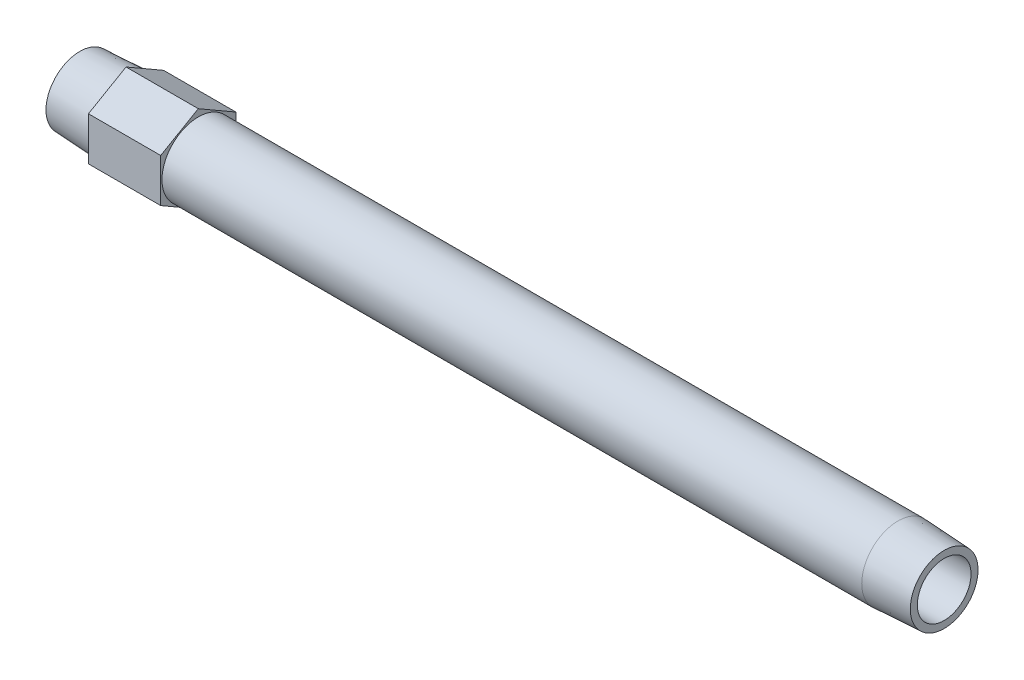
ISO-10303-21;
HEADER;
FILE_DESCRIPTION(('STEP AP214'),'2;1');
FILE_NAME('part.step','',(''),(''),'','','');
FILE_SCHEMA(('AUTOMOTIVE_DESIGN { 1 0 10303 214 1 1 1 1 }'));
ENDSEC;
DATA;
#1=APPLICATION_CONTEXT('core data for automotive mechanical design processes');
#2=APPLICATION_PROTOCOL_DEFINITION('international standard','automotive_design',2000,#1);
#3=PRODUCT_CONTEXT('',#1,'mechanical');
#4=PRODUCT('Part','Part','',(#3));
#5=PRODUCT_RELATED_PRODUCT_CATEGORY('part','',(#4));
#6=PRODUCT_DEFINITION_FORMATION('','',#4);
#7=PRODUCT_DEFINITION_CONTEXT('part definition',#1,'design');
#8=PRODUCT_DEFINITION('design','',#6,#7);
#9=PRODUCT_DEFINITION_SHAPE('','',#8);
#10=(LENGTH_UNIT() NAMED_UNIT(*) SI_UNIT(.MILLI.,.METRE.));
#11=(NAMED_UNIT(*) PLANE_ANGLE_UNIT() SI_UNIT($,.RADIAN.));
#12=(NAMED_UNIT(*) SI_UNIT($,.STERADIAN.) SOLID_ANGLE_UNIT());
#13=UNCERTAINTY_MEASURE_WITH_UNIT(LENGTH_MEASURE(1.E-05),#10,'distance_accuracy_value','');
#14=(GEOMETRIC_REPRESENTATION_CONTEXT(3) GLOBAL_UNCERTAINTY_ASSIGNED_CONTEXT((#13)) GLOBAL_UNIT_ASSIGNED_CONTEXT((#10,
#11,#12)) REPRESENTATION_CONTEXT('',''));
#15=CARTESIAN_POINT('',(0.,0.,0.));
#16=DIRECTION('',(0.,0.,1.));
#17=DIRECTION('',(1.,0.,0.));
#18=AXIS2_PLACEMENT_3D('',#15,#16,#17);
#19=CARTESIAN_POINT('',(0.,0.,-9.95716184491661));
#20=DIRECTION('',(1.,0.,0.));
#21=DIRECTION('',(0.,0.,-1.));
#22=AXIS2_PLACEMENT_3D('',#19,#20,#21);
#23=PLANE('',#22);
#24=CARTESIAN_POINT('',(0.,0.,0.));
#25=DIRECTION('',(-1.,0.,0.));
#26=DIRECTION('',(0.,0.,1.));
#27=AXIS2_PLACEMENT_3D('',#24,#25,#26);
#28=CIRCLE('',#27,9.95716184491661);
#29=CARTESIAN_POINT('',(0.,0.,9.95716184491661));
#30=VERTEX_POINT('',#29);
#31=EDGE_CURVE('E147',#30,#30,#28,.T.);
#32=ORIENTED_EDGE('',*,*,#31,.T.);
#33=EDGE_LOOP('',(#32));
#34=FACE_BOUND('',#33,.T.);
#35=CARTESIAN_POINT('',(0.,0.,0.));
#36=DIRECTION('',(1.,0.,0.));
#37=DIRECTION('',(0.,0.,1.));
#38=AXIS2_PLACEMENT_3D('',#35,#36,#37);
#39=CIRCLE('',#38,7.8994);
#40=CARTESIAN_POINT('',(0.,0.,7.8994));
#41=VERTEX_POINT('',#40);
#42=EDGE_CURVE('E159',#41,#41,#39,.T.);
#43=ORIENTED_EDGE('',*,*,#42,.T.);
#44=EDGE_LOOP('',(#43));
#45=FACE_BOUND('',#44,.T.);
#46=ADVANCED_FACE('F15',(#34,#45),#23,.F.);
#47=CARTESIAN_POINT('',(254.,0.,-9.95716184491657));
#48=DIRECTION('',(-1.,0.,0.));
#49=DIRECTION('',(0.,0.,1.));
#50=AXIS2_PLACEMENT_3D('',#47,#48,#49);
#51=PLANE('',#50);
#52=CARTESIAN_POINT('',(254.,0.,0.));
#53=DIRECTION('',(-1.,0.,0.));
#54=DIRECTION('',(0.,0.,1.));
#55=AXIS2_PLACEMENT_3D('',#52,#53,#54);
#56=CIRCLE('',#55,9.95716184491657);
#57=CARTESIAN_POINT('',(254.,0.,9.95716184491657));
#58=VERTEX_POINT('',#57);
#59=EDGE_CURVE('E150',#58,#58,#56,.T.);
#60=ORIENTED_EDGE('',*,*,#59,.F.);
#61=EDGE_LOOP('',(#60));
#62=FACE_BOUND('',#61,.T.);
#63=CARTESIAN_POINT('',(254.,0.,0.));
#64=DIRECTION('',(-1.,0.,0.));
#65=DIRECTION('',(0.,0.,1.));
#66=AXIS2_PLACEMENT_3D('',#63,#64,#65);
#67=CIRCLE('',#66,7.8994);
#68=CARTESIAN_POINT('',(254.,0.,7.8994));
#69=VERTEX_POINT('',#68);
#70=EDGE_CURVE('E156',#69,#69,#67,.F.);
#71=ORIENTED_EDGE('',*,*,#70,.F.);
#72=EDGE_LOOP('',(#71));
#73=FACE_BOUND('',#72,.T.);
#74=ADVANCED_FACE('F178',(#62,#73),#51,.F.);
#75=CARTESIAN_POINT('',(34.798,-6.37914312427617,-11.049));
#76=DIRECTION('',(1.,0.,0.));
#77=DIRECTION('',(0.,1.,0.));
#78=AXIS2_PLACEMENT_3D('',#75,#76,#77);
#79=PLANE('',#78);
#80=DIRECTION('',(0.,0.5,-0.866025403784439));
#81=VECTOR('',#80,1.);
#82=CARTESIAN_POINT('',(34.798,-12.7582862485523,0.));
#83=LINE('',#82,#81);
#84=CARTESIAN_POINT('',(34.798,-12.7582862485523,0.));
#85=VERTEX_POINT('',#84);
#86=CARTESIAN_POINT('',(34.798,-6.37914312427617,-11.049));
#87=VERTEX_POINT('',#86);
#88=EDGE_CURVE('E103',#85,#87,#83,.T.);
#89=ORIENTED_EDGE('',*,*,#88,.T.);
#90=DIRECTION('',(0.,1.,0.));
#91=VECTOR('',#90,1.);
#92=CARTESIAN_POINT('',(34.798,-6.37914312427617,-11.049));
#93=LINE('',#92,#91);
#94=CARTESIAN_POINT('',(34.798,6.37914312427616,-11.049));
#95=VERTEX_POINT('',#94);
#96=EDGE_CURVE('E83',#87,#95,#93,.T.);
#97=ORIENTED_EDGE('',*,*,#96,.T.);
#98=DIRECTION('',(0.,0.5,0.866025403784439));
#99=VECTOR('',#98,1.);
#100=CARTESIAN_POINT('',(34.798,6.37914312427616,-11.049));
#101=LINE('',#100,#99);
#102=CARTESIAN_POINT('',(34.798,12.7582862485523,0.));
#103=VERTEX_POINT('',#102);
#104=EDGE_CURVE('E102',#95,#103,#101,.T.);
#105=ORIENTED_EDGE('',*,*,#104,.T.);
#106=DIRECTION('',(0.,-0.5,0.866025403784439));
#107=VECTOR('',#106,1.);
#108=CARTESIAN_POINT('',(34.798,12.7582862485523,0.));
#109=LINE('',#108,#107);
#110=CARTESIAN_POINT('',(34.798,6.37914312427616,11.049));
#111=VERTEX_POINT('',#110);
#112=EDGE_CURVE('E105',#103,#111,#109,.T.);
#113=ORIENTED_EDGE('',*,*,#112,.T.);
#114=DIRECTION('',(0.,-1.,0.));
#115=VECTOR('',#114,1.);
#116=CARTESIAN_POINT('',(34.798,6.37914312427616,11.049));
#117=LINE('',#116,#115);
#118=CARTESIAN_POINT('',(34.798,-6.37914312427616,11.049));
#119=VERTEX_POINT('',#118);
#120=EDGE_CURVE('E35',#111,#119,#117,.T.);
#121=ORIENTED_EDGE('',*,*,#120,.T.);
#122=DIRECTION('',(0.,-0.5,-0.866025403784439));
#123=VECTOR('',#122,1.);
#124=CARTESIAN_POINT('',(34.798,-6.37914312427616,11.049));
#125=LINE('',#124,#123);
#126=EDGE_CURVE('E30',#119,#85,#125,.T.);
#127=ORIENTED_EDGE('',*,*,#126,.T.);
#128=EDGE_LOOP('',(#89,#97,#105,#113,#121,#127));
#129=FACE_BOUND('',#128,.T.);
#130=CARTESIAN_POINT('',(34.798,0.,0.));
#131=DIRECTION('',(1.,0.,0.));
#132=DIRECTION('',(0.,1.,0.));
#133=AXIS2_PLACEMENT_3D('',#130,#131,#132);
#134=CIRCLE('',#133,10.668);
#135=CARTESIAN_POINT('',(34.798,10.668,0.));
#136=VERTEX_POINT('',#135);
#137=EDGE_CURVE('E89',#136,#136,#134,.F.);
#138=ORIENTED_EDGE('',*,*,#137,.T.);
#139=EDGE_LOOP('',(#138));
#140=FACE_BOUND('',#139,.T.);
#141=ADVANCED_FACE('F124',(#129,#140),#79,.T.);
#142=CARTESIAN_POINT('',(13.5636,-6.37914312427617,-11.049));
#143=DIRECTION('',(1.,0.,0.));
#144=DIRECTION('',(0.,1.,0.));
#145=AXIS2_PLACEMENT_3D('',#142,#143,#144);
#146=PLANE('',#145);
#147=DIRECTION('',(0.,0.5,-0.866025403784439));
#148=VECTOR('',#147,1.);
#149=CARTESIAN_POINT('',(13.5636,-12.7582862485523,0.));
#150=LINE('',#149,#148);
#151=CARTESIAN_POINT('',(13.5636,-12.7582862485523,0.));
#152=VERTEX_POINT('',#151);
#153=CARTESIAN_POINT('',(13.5636,-6.37914312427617,-11.049));
#154=VERTEX_POINT('',#153);
#155=EDGE_CURVE('E73',#152,#154,#150,.T.);
#156=ORIENTED_EDGE('',*,*,#155,.F.);
#157=DIRECTION('',(0.,-0.5,-0.866025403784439));
#158=VECTOR('',#157,1.);
#159=CARTESIAN_POINT('',(13.5636,-6.37914312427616,11.049));
#160=LINE('',#159,#158);
#161=CARTESIAN_POINT('',(13.5636,-6.37914312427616,11.049));
#162=VERTEX_POINT('',#161);
#163=EDGE_CURVE('E99',#162,#152,#160,.T.);
#164=ORIENTED_EDGE('',*,*,#163,.F.);
#165=DIRECTION('',(0.,-1.,0.));
#166=VECTOR('',#165,1.);
#167=CARTESIAN_POINT('',(13.5636,6.37914312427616,11.049));
#168=LINE('',#167,#166);
#169=CARTESIAN_POINT('',(13.5636,6.37914312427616,11.049));
#170=VERTEX_POINT('',#169);
#171=EDGE_CURVE('E133',#170,#162,#168,.T.);
#172=ORIENTED_EDGE('',*,*,#171,.F.);
#173=DIRECTION('',(0.,-0.5,0.866025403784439));
#174=VECTOR('',#173,1.);
#175=CARTESIAN_POINT('',(13.5636,12.7582862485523,0.));
#176=LINE('',#175,#174);
#177=CARTESIAN_POINT('',(13.5636,12.7582862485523,0.));
#178=VERTEX_POINT('',#177);
#179=EDGE_CURVE('E129',#178,#170,#176,.T.);
#180=ORIENTED_EDGE('',*,*,#179,.F.);
#181=DIRECTION('',(0.,0.5,0.866025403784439));
#182=VECTOR('',#181,1.);
#183=CARTESIAN_POINT('',(13.5636,6.37914312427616,-11.049));
#184=LINE('',#183,#182);
#185=CARTESIAN_POINT('',(13.5636,6.37914312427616,-11.049));
#186=VERTEX_POINT('',#185);
#187=EDGE_CURVE('E75',#186,#178,#184,.T.);
#188=ORIENTED_EDGE('',*,*,#187,.F.);
#189=DIRECTION('',(0.,1.,0.));
#190=VECTOR('',#189,1.);
#191=CARTESIAN_POINT('',(13.5636,-6.37914312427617,-11.049));
#192=LINE('',#191,#190);
#193=EDGE_CURVE('E68',#154,#186,#192,.T.);
#194=ORIENTED_EDGE('',*,*,#193,.F.);
#195=EDGE_LOOP('',(#156,#164,#172,#180,#188,#194));
#196=FACE_BOUND('',#195,.T.);
#197=CARTESIAN_POINT('',(13.5636,0.,0.));
#198=DIRECTION('',(-1.,0.,0.));
#199=DIRECTION('',(0.,0.,1.));
#200=AXIS2_PLACEMENT_3D('',#197,#198,#199);
#201=CIRCLE('',#200,10.668);
#202=CARTESIAN_POINT('',(13.5636,0.,10.668));
#203=VERTEX_POINT('',#202);
#204=EDGE_CURVE('E95',#203,#203,#201,.T.);
#205=ORIENTED_EDGE('',*,*,#204,.F.);
#206=EDGE_LOOP('',(#205));
#207=FACE_BOUND('',#206,.T.);
#208=ADVANCED_FACE('F69',(#196,#207),#146,.F.);
#209=CARTESIAN_POINT('',(34.798,-12.7582862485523,0.));
#210=DIRECTION('',(0.,0.866025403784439,0.5));
#211=DIRECTION('',(0.,-0.5,0.866025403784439));
#212=AXIS2_PLACEMENT_3D('',#209,#210,#211);
#213=PLANE('',#212);
#214=ORIENTED_EDGE('',*,*,#155,.T.);
#215=DIRECTION('',(-1.,0.,0.));
#216=VECTOR('',#215,1.);
#217=CARTESIAN_POINT('',(34.798,-6.37914312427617,-11.049));
#218=LINE('',#217,#216);
#219=EDGE_CURVE('E10',#87,#154,#218,.T.);
#220=ORIENTED_EDGE('',*,*,#219,.F.);
#221=ORIENTED_EDGE('',*,*,#88,.F.);
#222=DIRECTION('',(-1.,0.,0.));
#223=VECTOR('',#222,1.);
#224=CARTESIAN_POINT('',(34.798,-12.7582862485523,0.));
#225=LINE('',#224,#223);
#226=EDGE_CURVE('E87',#85,#152,#225,.T.);
#227=ORIENTED_EDGE('',*,*,#226,.T.);
#228=EDGE_LOOP('',(#214,#220,#221,#227));
#229=FACE_BOUND('',#228,.T.);
#230=ADVANCED_FACE('F17',(#229),#213,.F.);
#231=CARTESIAN_POINT('',(34.798,-6.37914312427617,-11.049));
#232=DIRECTION('',(0.,0.,1.));
#233=DIRECTION('',(1.,0.,0.));
#234=AXIS2_PLACEMENT_3D('',#231,#232,#233);
#235=PLANE('',#234);
#236=ORIENTED_EDGE('',*,*,#193,.T.);
#237=DIRECTION('',(-1.,0.,0.));
#238=VECTOR('',#237,1.);
#239=CARTESIAN_POINT('',(34.798,6.37914312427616,-11.049));
#240=LINE('',#239,#238);
#241=EDGE_CURVE('E23',#95,#186,#240,.T.);
#242=ORIENTED_EDGE('',*,*,#241,.F.);
#243=ORIENTED_EDGE('',*,*,#96,.F.);
#244=ORIENTED_EDGE('',*,*,#219,.T.);
#245=EDGE_LOOP('',(#236,#242,#243,#244));
#246=FACE_BOUND('',#245,.T.);
#247=ADVANCED_FACE('F82',(#246),#235,.F.);
#248=CARTESIAN_POINT('',(34.798,6.37914312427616,-11.049));
#249=DIRECTION('',(0.,-0.866025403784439,0.5));
#250=DIRECTION('',(0.,-0.5,-0.866025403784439));
#251=AXIS2_PLACEMENT_3D('',#248,#249,#250);
#252=PLANE('',#251);
#253=ORIENTED_EDGE('',*,*,#187,.T.);
#254=DIRECTION('',(-1.,0.,0.));
#255=VECTOR('',#254,1.);
#256=CARTESIAN_POINT('',(34.798,12.7582862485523,0.));
#257=LINE('',#256,#255);
#258=EDGE_CURVE('E117',#103,#178,#257,.T.);
#259=ORIENTED_EDGE('',*,*,#258,.F.);
#260=ORIENTED_EDGE('',*,*,#104,.F.);
#261=ORIENTED_EDGE('',*,*,#241,.T.);
#262=EDGE_LOOP('',(#253,#259,#260,#261));
#263=FACE_BOUND('',#262,.T.);
#264=ADVANCED_FACE('F121',(#263),#252,.F.);
#265=CARTESIAN_POINT('',(34.798,12.7582862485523,0.));
#266=DIRECTION('',(0.,-0.866025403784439,-0.5));
#267=DIRECTION('',(0.,0.5,-0.866025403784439));
#268=AXIS2_PLACEMENT_3D('',#265,#266,#267);
#269=PLANE('',#268);
#270=ORIENTED_EDGE('',*,*,#179,.T.);
#271=DIRECTION('',(-1.,0.,0.));
#272=VECTOR('',#271,1.);
#273=CARTESIAN_POINT('',(34.798,6.37914312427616,11.049));
#274=LINE('',#273,#272);
#275=EDGE_CURVE('E114',#111,#170,#274,.T.);
#276=ORIENTED_EDGE('',*,*,#275,.F.);
#277=ORIENTED_EDGE('',*,*,#112,.F.);
#278=ORIENTED_EDGE('',*,*,#258,.T.);
#279=EDGE_LOOP('',(#270,#276,#277,#278));
#280=FACE_BOUND('',#279,.T.);
#281=ADVANCED_FACE('F128',(#280),#269,.F.);
#282=CARTESIAN_POINT('',(34.798,6.37914312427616,11.049));
#283=DIRECTION('',(0.,0.,-1.));
#284=DIRECTION('',(-1.,0.,0.));
#285=AXIS2_PLACEMENT_3D('',#282,#283,#284);
#286=PLANE('',#285);
#287=ORIENTED_EDGE('',*,*,#171,.T.);
#288=DIRECTION('',(-1.,0.,0.));
#289=VECTOR('',#288,1.);
#290=CARTESIAN_POINT('',(34.798,-6.37914312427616,11.049));
#291=LINE('',#290,#289);
#292=EDGE_CURVE('E111',#119,#162,#291,.T.);
#293=ORIENTED_EDGE('',*,*,#292,.F.);
#294=ORIENTED_EDGE('',*,*,#120,.F.);
#295=ORIENTED_EDGE('',*,*,#275,.T.);
#296=EDGE_LOOP('',(#287,#293,#294,#295));
#297=FACE_BOUND('',#296,.T.);
#298=ADVANCED_FACE('F132',(#297),#286,.F.);
#299=CARTESIAN_POINT('',(34.798,-6.37914312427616,11.049));
#300=DIRECTION('',(0.,0.866025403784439,-0.5));
#301=DIRECTION('',(0.,0.5,0.866025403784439));
#302=AXIS2_PLACEMENT_3D('',#299,#300,#301);
#303=PLANE('',#302);
#304=ORIENTED_EDGE('',*,*,#163,.T.);
#305=ORIENTED_EDGE('',*,*,#226,.F.);
#306=ORIENTED_EDGE('',*,*,#126,.F.);
#307=ORIENTED_EDGE('',*,*,#292,.T.);
#308=EDGE_LOOP('',(#304,#305,#306,#307));
#309=FACE_BOUND('',#308,.T.);
#310=ADVANCED_FACE('F135',(#309),#303,.F.);
#311=CARTESIAN_POINT('',(13.5636,0.,0.));
#312=DIRECTION('',(1.,0.,0.));
#313=DIRECTION('',(0.,0.,-1.));
#314=AXIS2_PLACEMENT_3D('',#311,#312,#313);
#315=CONICAL_SURFACE('',#314,10.668,0.0523598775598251);
#316=ORIENTED_EDGE('',*,*,#31,.F.);
#317=EDGE_LOOP('',(#316));
#318=FACE_BOUND('',#317,.T.);
#319=ORIENTED_EDGE('',*,*,#204,.T.);
#320=EDGE_LOOP('',(#319));
#321=FACE_BOUND('',#320,.T.);
#322=ADVANCED_FACE('F187',(#318,#321),#315,.T.);
#323=CARTESIAN_POINT('',(-60.,0.,0.));
#324=DIRECTION('',(-1.,0.,0.));
#325=DIRECTION('',(0.,0.,1.));
#326=AXIS2_PLACEMENT_3D('',#323,#324,#325);
#327=CYLINDRICAL_SURFACE('',#326,10.668);
#328=ORIENTED_EDGE('',*,*,#137,.F.);
#329=EDGE_LOOP('',(#328));
#330=FACE_BOUND('',#329,.T.);
#331=CARTESIAN_POINT('',(240.4364,0.,0.));
#332=DIRECTION('',(-1.,0.,0.));
#333=DIRECTION('',(0.,0.,1.));
#334=AXIS2_PLACEMENT_3D('',#331,#332,#333);
#335=CIRCLE('',#334,10.668);
#336=CARTESIAN_POINT('',(240.4364,0.,10.668));
#337=VERTEX_POINT('',#336);
#338=EDGE_CURVE('E153',#337,#337,#335,.T.);
#339=ORIENTED_EDGE('',*,*,#338,.T.);
#340=EDGE_LOOP('',(#339));
#341=FACE_BOUND('',#340,.T.);
#342=ADVANCED_FACE('F174',(#330,#341),#327,.T.);
#343=CARTESIAN_POINT('',(254.,0.,0.));
#344=DIRECTION('',(-1.,0.,0.));
#345=DIRECTION('',(0.,0.,1.));
#346=AXIS2_PLACEMENT_3D('',#343,#344,#345);
#347=CONICAL_SURFACE('',#346,9.95716184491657,0.0523598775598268);
#348=ORIENTED_EDGE('',*,*,#338,.F.);
#349=EDGE_LOOP('',(#348));
#350=FACE_BOUND('',#349,.T.);
#351=ORIENTED_EDGE('',*,*,#59,.T.);
#352=EDGE_LOOP('',(#351));
#353=FACE_BOUND('',#352,.T.);
#354=ADVANCED_FACE('F167',(#350,#353),#347,.T.);
#355=CARTESIAN_POINT('',(256.23313032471,0.,0.));
#356=DIRECTION('',(-1.,0.,0.));
#357=DIRECTION('',(0.,0.,1.));
#358=AXIS2_PLACEMENT_3D('',#355,#356,#357);
#359=CYLINDRICAL_SURFACE('',#358,7.8994);
#360=ORIENTED_EDGE('',*,*,#70,.T.);
#361=EDGE_LOOP('',(#360));
#362=FACE_BOUND('',#361,.T.);
#363=ORIENTED_EDGE('',*,*,#42,.F.);
#364=EDGE_LOOP('',(#363));
#365=FACE_BOUND('',#364,.T.);
#366=ADVANCED_FACE('F165',(#362,#365),#359,.F.);
#367=CLOSED_SHELL('',(#46,#74,#141,#208,#230,#247,#264,#281,#298,#310,#322,#342,#354,#366));
#368=MANIFOLD_SOLID_BREP('B1',#367);
#369=ADVANCED_BREP_SHAPE_REPRESENTATION('',(#18,#368),#14);
#370=SHAPE_DEFINITION_REPRESENTATION(#9,#369);
ENDSEC;
END-ISO-10303-21;
